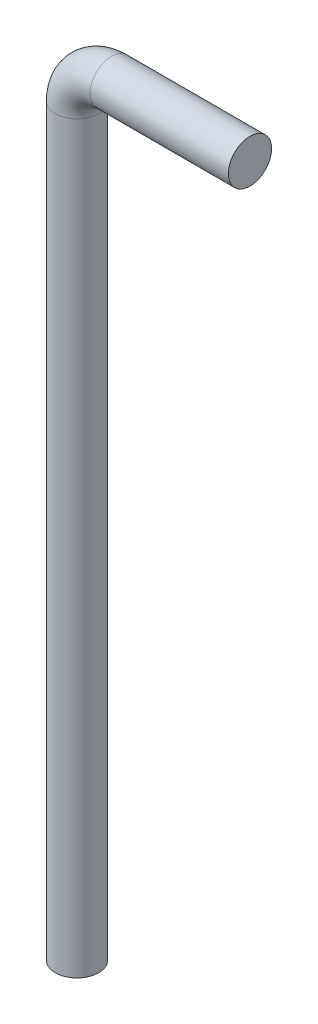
ISO-10303-21;
HEADER;
FILE_DESCRIPTION(('STEP AP214'),'2;1');
FILE_NAME('part.step','',(''),(''),'','','');
FILE_SCHEMA(('AUTOMOTIVE_DESIGN { 1 0 10303 214 1 1 1 1 }'));
ENDSEC;
DATA;
#1=APPLICATION_CONTEXT('core data for automotive mechanical design processes');
#2=APPLICATION_PROTOCOL_DEFINITION('international standard','automotive_design',2000,#1);
#3=PRODUCT_CONTEXT('',#1,'mechanical');
#4=PRODUCT('Part','Part','',(#3));
#5=PRODUCT_RELATED_PRODUCT_CATEGORY('part','',(#4));
#6=PRODUCT_DEFINITION_FORMATION('','',#4);
#7=PRODUCT_DEFINITION_CONTEXT('part definition',#1,'design');
#8=PRODUCT_DEFINITION('design','',#6,#7);
#9=PRODUCT_DEFINITION_SHAPE('','',#8);
#10=(LENGTH_UNIT() NAMED_UNIT(*) SI_UNIT(.MILLI.,.METRE.));
#11=(NAMED_UNIT(*) PLANE_ANGLE_UNIT() SI_UNIT($,.RADIAN.));
#12=(NAMED_UNIT(*) SI_UNIT($,.STERADIAN.) SOLID_ANGLE_UNIT());
#13=UNCERTAINTY_MEASURE_WITH_UNIT(LENGTH_MEASURE(1.E-05),#10,'distance_accuracy_value','');
#14=(GEOMETRIC_REPRESENTATION_CONTEXT(3) GLOBAL_UNCERTAINTY_ASSIGNED_CONTEXT((#13)) GLOBAL_UNIT_ASSIGNED_CONTEXT((#10,
#11,#12)) REPRESENTATION_CONTEXT('',''));
#15=CARTESIAN_POINT('',(0.,0.,0.));
#16=DIRECTION('',(0.,0.,1.));
#17=DIRECTION('',(1.,0.,0.));
#18=AXIS2_PLACEMENT_3D('',#15,#16,#17);
#19=CARTESIAN_POINT('',(0.,0.,0.));
#20=DIRECTION('',(1.,0.,0.));
#21=DIRECTION('',(0.,0.,-1.));
#22=AXIS2_PLACEMENT_3D('',#19,#20,#21);
#23=PLANE('',#22);
#24=CARTESIAN_POINT('',(0.,0.,0.));
#25=DIRECTION('',(1.,0.,0.));
#26=DIRECTION('',(0.,0.,-1.));
#27=AXIS2_PLACEMENT_3D('',#24,#25,#26);
#28=CIRCLE('',#27,1.25);
#29=CARTESIAN_POINT('',(0.,0.,-1.25));
#30=VERTEX_POINT('',#29);
#31=EDGE_CURVE('E64',#30,#30,#28,.T.);
#32=ORIENTED_EDGE('',*,*,#31,.T.);
#33=EDGE_LOOP('',(#32));
#34=FACE_BOUND('',#33,.T.);
#35=ADVANCED_FACE('F47',(#34),#23,.T.);
#36=CARTESIAN_POINT('',(-9.99999999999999,-45.,0.));
#37=DIRECTION('',(0.,1.,0.));
#38=DIRECTION('',(0.,0.,-1.));
#39=AXIS2_PLACEMENT_3D('',#36,#37,#38);
#40=PLANE('',#39);
#41=CARTESIAN_POINT('',(-9.99999999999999,-45.,0.));
#42=DIRECTION('',(0.,1.,0.));
#43=DIRECTION('',(0.,0.,-1.));
#44=AXIS2_PLACEMENT_3D('',#41,#42,#43);
#45=CIRCLE('',#44,1.25);
#46=CARTESIAN_POINT('',(-9.99999999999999,-45.,-1.25));
#47=VERTEX_POINT('',#46);
#48=EDGE_CURVE('E12',#47,#47,#45,.T.);
#49=ORIENTED_EDGE('',*,*,#48,.F.);
#50=EDGE_LOOP('',(#49));
#51=FACE_BOUND('',#50,.T.);
#52=ADVANCED_FACE('F75',(#51),#40,.F.);
#53=CARTESIAN_POINT('',(0.,0.,0.));
#54=DIRECTION('',(-1.,0.,0.));
#55=DIRECTION('',(0.,0.,1.));
#56=AXIS2_PLACEMENT_3D('',#53,#54,#55);
#57=CYLINDRICAL_SURFACE('',#56,1.25);
#58=CARTESIAN_POINT('',(-7.99999999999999,0.,0.));
#59=DIRECTION('',(1.,0.,0.));
#60=DIRECTION('',(0.,0.,-1.));
#61=AXIS2_PLACEMENT_3D('',#58,#59,#60);
#62=CIRCLE('',#61,1.25);
#63=CARTESIAN_POINT('',(-7.99999999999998,1.25,0.));
#64=VERTEX_POINT('',#63);
#65=EDGE_CURVE('E59',#64,#64,#62,.T.);
#66=ORIENTED_EDGE('',*,*,#65,.T.);
#67=EDGE_LOOP('',(#66));
#68=FACE_BOUND('',#67,.T.);
#69=ORIENTED_EDGE('',*,*,#31,.F.);
#70=EDGE_LOOP('',(#69));
#71=FACE_BOUND('',#70,.T.);
#72=ADVANCED_FACE('F72',(#68,#71),#57,.T.);
#73=CARTESIAN_POINT('',(-8.,-2.,0.));
#74=DIRECTION('',(0.,0.,1.));
#75=DIRECTION('',(1.,0.,0.));
#76=AXIS2_PLACEMENT_3D('',#73,#74,#75);
#77=TOROIDAL_SURFACE('',#76,2.,1.25);
#78=CARTESIAN_POINT('',(-10.,-2.,0.));
#79=DIRECTION('',(0.,1.,0.));
#80=DIRECTION('',(0.,0.,-1.));
#81=AXIS2_PLACEMENT_3D('',#78,#79,#80);
#82=CIRCLE('',#81,1.25);
#83=CARTESIAN_POINT('',(-11.25,-2.,0.));
#84=VERTEX_POINT('',#83);
#85=EDGE_CURVE('E54',#84,#84,#82,.T.);
#86=CARTESIAN_POINT('',(-8.,-2.,0.));
#87=DIRECTION('',(0.,0.,1.));
#88=DIRECTION('',(1.,0.,0.));
#89=AXIS2_PLACEMENT_3D('',#86,#87,#88);
#90=CIRCLE('',#89,3.25);
#91=EDGE_CURVE('',#64,#84,#90,.T.);
#92=ORIENTED_EDGE('',*,*,#65,.F.);
#93=ORIENTED_EDGE('',*,*,#85,.T.);
#94=ORIENTED_EDGE('',*,*,#91,.T.);
#95=ORIENTED_EDGE('',*,*,#91,.F.);
#96=EDGE_LOOP('',(#92,#94,#93,#95));
#97=FACE_BOUND('',#96,.T.);
#98=ADVANCED_FACE('F74',(#97),#77,.T.);
#99=CARTESIAN_POINT('',(-10.,-2.00000000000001,0.));
#100=DIRECTION('',(0.,-1.,0.));
#101=DIRECTION('',(1.,0.,0.));
#102=AXIS2_PLACEMENT_3D('',#99,#100,#101);
#103=CYLINDRICAL_SURFACE('',#102,1.25);
#104=ORIENTED_EDGE('',*,*,#48,.T.);
#105=EDGE_LOOP('',(#104));
#106=FACE_BOUND('',#105,.T.);
#107=ORIENTED_EDGE('',*,*,#85,.F.);
#108=EDGE_LOOP('',(#107));
#109=FACE_BOUND('',#108,.T.);
#110=ADVANCED_FACE('F82',(#106,#109),#103,.T.);
#111=CLOSED_SHELL('',(#35,#52,#72,#98,#110));
#112=MANIFOLD_SOLID_BREP('B2',#111);
#113=ADVANCED_BREP_SHAPE_REPRESENTATION('',(#18,#112),#14);
#114=SHAPE_DEFINITION_REPRESENTATION(#9,#113);
ENDSEC;
END-ISO-10303-21;
